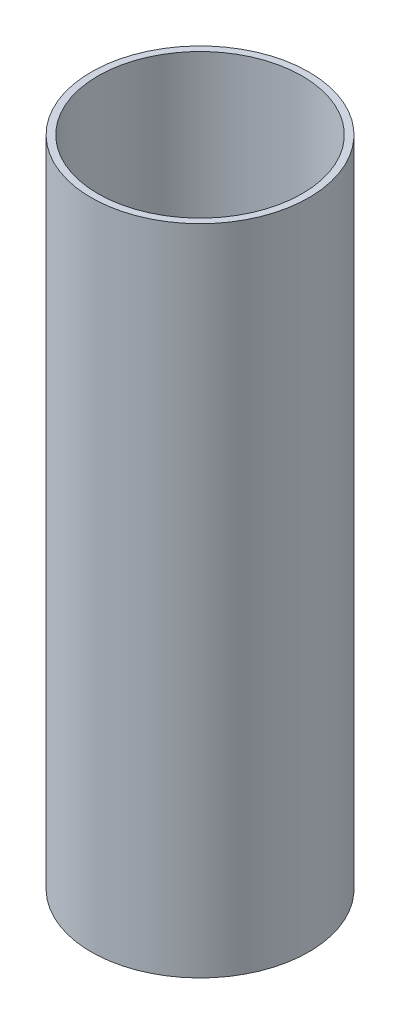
from build123d import *

# Parameters (mm, degrees)
SKETCH1_R           = 25.4
SKETCH1_R_2         = 23.8125
BOSS_EXTRUDE1_DEPTH = 152.4


with BuildPart() as part:
    # Sketch1 → Boss-Extrude1 (new body)
    with BuildSketch(Plane(origin=(0, 0, 0), x_dir=(1, 0, 0), z_dir=(0, 1, 0))):
        with Locations(Location((0, 0, 0), (0, 0, 90))):
            Circle(SKETCH1_R)
        with Locations(Location((0, 0, 0), (0, 0, 90))):
            Circle(SKETCH1_R_2, mode=Mode.SUBTRACT)
    extrude(amount=BOSS_EXTRUDE1_DEPTH)


solid = part.part
